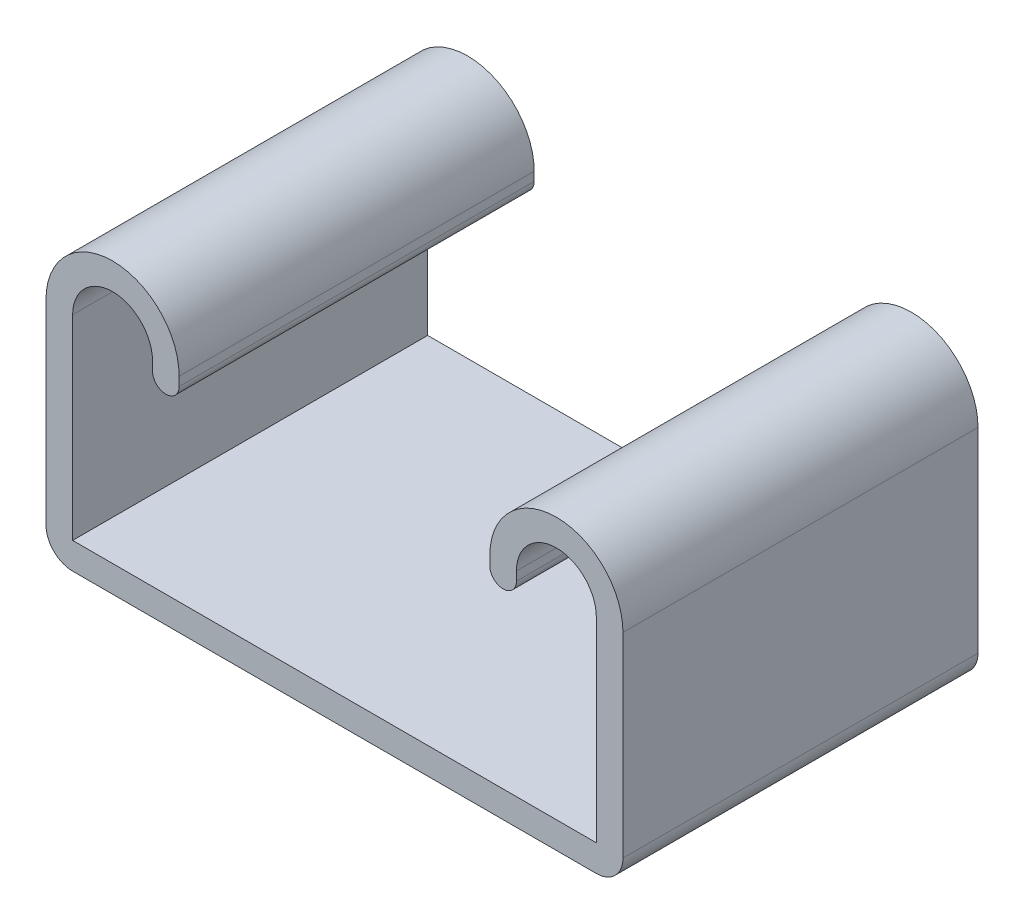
from build123d import *

# Parameters (mm, degrees)
BASE_EXTRUDE_DEPTH = 12.7


with BuildPart() as part:
    # Sketch1 → Base-Extrude (new, symmetric)
    with BuildSketch(Plane.XY):
        with BuildLine():
            Line((-20.6375, 7.4295), (-20.6375, -6.5532))
            ThreePointArc((-20.6375, -6.5532), (-20.079538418, -7.900238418), (-18.7325, -8.4582))
            Line((-18.7325, -8.4582), (18.7325, -8.4582))
            ThreePointArc((18.7325, -8.4582), (20.079538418, -7.900238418), (20.6375, -6.5532))
            Line((20.6375, -6.5532), (20.6375, 7.4295))
            ThreePointArc((20.6375, 7.4295), (15.875, 12.192), (11.1125, 7.4295))
            Line((11.1125, 7.4295), (11.1125, 6.7945))
            ThreePointArc((11.1125, 6.7945), (12.065, 5.842), (13.0175, 6.7945))
            Line((13.0175, 6.7945), (13.0175, 7.4295))
            ThreePointArc((13.0175, 7.4295), (15.875, 10.287), (18.7325, 7.4295))
            Line((18.7325, 7.4295), (18.7325, -6.5532))
            Line((18.7325, -6.5532), (-18.7325, -6.5532))
            Line((-18.7325, -6.5532), (-18.7325, 7.4295))
            ThreePointArc((-18.7325, 7.4295), (-15.875, 10.287), (-13.0175, 7.4295))
            Line((-13.0175, 7.4295), (-13.0175, 6.7945))
            ThreePointArc((-13.0175, 6.7945), (-12.065, 5.842), (-11.1125, 6.7945))
            Line((-11.1125, 6.7945), (-11.1125, 7.4295))
            ThreePointArc((-11.1125, 7.4295), (-15.875, 12.192), (-20.6375, 7.4295))
        make_face()
    extrude(amount=BASE_EXTRUDE_DEPTH, both=True)


solid = part.part
